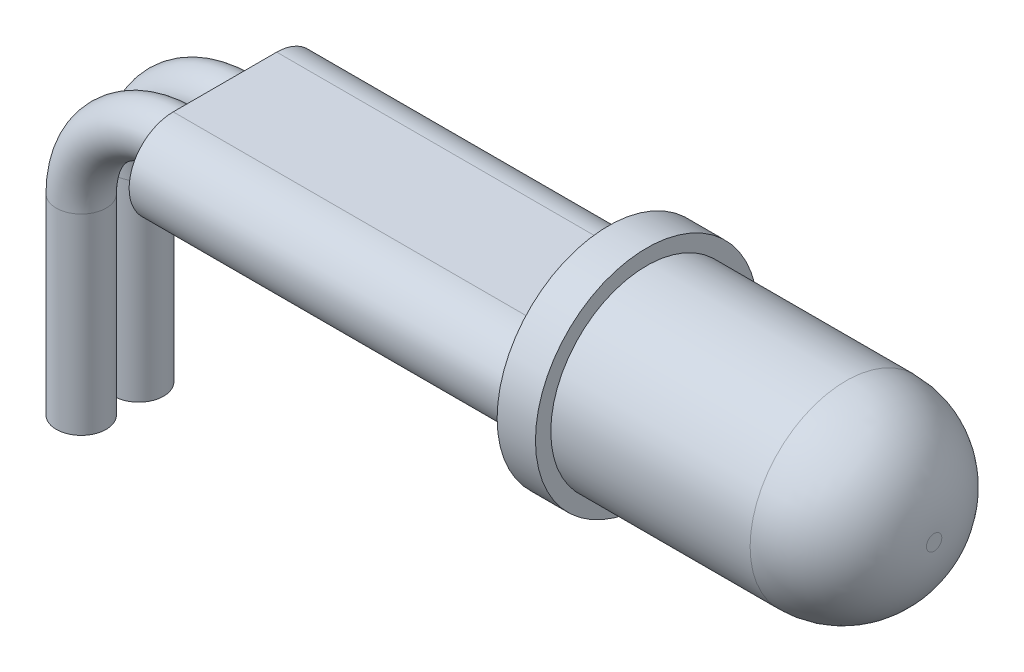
ISO-10303-21;
HEADER;
FILE_DESCRIPTION(('STEP AP214'),'2;1');
FILE_NAME('part.step','',(''),(''),'','','');
FILE_SCHEMA(('AUTOMOTIVE_DESIGN { 1 0 10303 214 1 1 1 1 }'));
ENDSEC;
DATA;
#1=APPLICATION_CONTEXT('core data for automotive mechanical design processes');
#2=APPLICATION_PROTOCOL_DEFINITION('international standard','automotive_design',2000,#1);
#3=PRODUCT_CONTEXT('',#1,'mechanical');
#4=PRODUCT('Part','Part','',(#3));
#5=PRODUCT_RELATED_PRODUCT_CATEGORY('part','',(#4));
#6=PRODUCT_DEFINITION_FORMATION('','',#4);
#7=PRODUCT_DEFINITION_CONTEXT('part definition',#1,'design');
#8=PRODUCT_DEFINITION('design','',#6,#7);
#9=PRODUCT_DEFINITION_SHAPE('','',#8);
#10=(LENGTH_UNIT() NAMED_UNIT(*) SI_UNIT(.MILLI.,.METRE.));
#11=(NAMED_UNIT(*) PLANE_ANGLE_UNIT() SI_UNIT($,.RADIAN.));
#12=(NAMED_UNIT(*) SI_UNIT($,.STERADIAN.) SOLID_ANGLE_UNIT());
#13=UNCERTAINTY_MEASURE_WITH_UNIT(LENGTH_MEASURE(1.E-05),#10,'distance_accuracy_value','');
#14=(GEOMETRIC_REPRESENTATION_CONTEXT(3) GLOBAL_UNCERTAINTY_ASSIGNED_CONTEXT((#13)) GLOBAL_UNIT_ASSIGNED_CONTEXT((#10,
#11,#12)) REPRESENTATION_CONTEXT('',''));
#15=CARTESIAN_POINT('',(0.,0.,0.));
#16=DIRECTION('',(0.,0.,1.));
#17=DIRECTION('',(1.,0.,0.));
#18=AXIS2_PLACEMENT_3D('',#15,#16,#17);
#19=CARTESIAN_POINT('',(-10.,0.,-1.35));
#20=DIRECTION('',(1.,0.,0.));
#21=DIRECTION('',(0.,0.,-1.));
#22=AXIS2_PLACEMENT_3D('',#19,#20,#21);
#23=CYLINDRICAL_SURFACE('',#22,1.15);
#24=CARTESIAN_POINT('',(0.,0.,-1.35));
#25=DIRECTION('',(-1.,0.,0.));
#26=DIRECTION('',(0.,0.,1.));
#27=AXIS2_PLACEMENT_3D('',#24,#25,#26);
#28=CIRCLE('',#27,1.15);
#29=CARTESIAN_POINT('',(0.,1.15,-1.35));
#30=VERTEX_POINT('',#29);
#31=CARTESIAN_POINT('',(0.,-1.15,-1.35));
#32=VERTEX_POINT('',#31);
#33=EDGE_CURVE('E112',#30,#32,#28,.T.);
#34=ORIENTED_EDGE('',*,*,#33,.T.);
#35=DIRECTION('',(1.,0.,0.));
#36=VECTOR('',#35,1.);
#37=CARTESIAN_POINT('',(-10.,-1.15,-1.35));
#38=LINE('',#37,#36);
#39=CARTESIAN_POINT('',(-10.,-1.15,-1.35));
#40=VERTEX_POINT('',#39);
#41=EDGE_CURVE('E48',#40,#32,#38,.T.);
#42=ORIENTED_EDGE('',*,*,#41,.F.);
#43=CARTESIAN_POINT('',(-10.,0.,-1.35));
#44=DIRECTION('',(-1.,0.,0.));
#45=DIRECTION('',(0.,0.,1.));
#46=AXIS2_PLACEMENT_3D('',#43,#44,#45);
#47=CIRCLE('',#46,1.15);
#48=CARTESIAN_POINT('',(-10.,1.15,-1.35));
#49=VERTEX_POINT('',#48);
#50=EDGE_CURVE('E99',#49,#40,#47,.T.);
#51=ORIENTED_EDGE('',*,*,#50,.F.);
#52=DIRECTION('',(1.,0.,0.));
#53=VECTOR('',#52,1.);
#54=CARTESIAN_POINT('',(-10.,1.15,-1.35));
#55=LINE('',#54,#53);
#56=EDGE_CURVE('E108',#49,#30,#55,.T.);
#57=ORIENTED_EDGE('',*,*,#56,.T.);
#58=EDGE_LOOP('',(#34,#42,#51,#57));
#59=FACE_BOUND('',#58,.T.);
#60=ADVANCED_FACE('F45',(#59),#23,.T.);
#61=CARTESIAN_POINT('',(-10.,-1.15,-1.35));
#62=DIRECTION('',(0.,1.,0.));
#63=DIRECTION('',(0.,0.,1.));
#64=AXIS2_PLACEMENT_3D('',#61,#62,#63);
#65=PLANE('',#64);
#66=DIRECTION('',(0.,0.,1.));
#67=VECTOR('',#66,1.);
#68=CARTESIAN_POINT('',(0.,-1.15,-1.35));
#69=LINE('',#68,#67);
#70=CARTESIAN_POINT('',(0.,-1.15,1.35));
#71=VERTEX_POINT('',#70);
#72=EDGE_CURVE('E104',#32,#71,#69,.T.);
#73=ORIENTED_EDGE('',*,*,#72,.T.);
#74=DIRECTION('',(1.,0.,0.));
#75=VECTOR('',#74,1.);
#76=CARTESIAN_POINT('',(-10.,-1.15,1.35));
#77=LINE('',#76,#75);
#78=CARTESIAN_POINT('',(-10.,-1.15,1.35));
#79=VERTEX_POINT('',#78);
#80=EDGE_CURVE('E102',#79,#71,#77,.T.);
#81=ORIENTED_EDGE('',*,*,#80,.F.);
#82=DIRECTION('',(0.,0.,1.));
#83=VECTOR('',#82,1.);
#84=CARTESIAN_POINT('',(-10.,-1.15,-1.35));
#85=LINE('',#84,#83);
#86=EDGE_CURVE('E94',#40,#79,#85,.T.);
#87=ORIENTED_EDGE('',*,*,#86,.F.);
#88=ORIENTED_EDGE('',*,*,#41,.T.);
#89=EDGE_LOOP('',(#73,#81,#87,#88));
#90=FACE_BOUND('',#89,.T.);
#91=ADVANCED_FACE('F103',(#90),#65,.F.);
#92=CARTESIAN_POINT('',(-10.,0.,1.35));
#93=DIRECTION('',(1.,0.,0.));
#94=DIRECTION('',(0.,0.,-1.));
#95=AXIS2_PLACEMENT_3D('',#92,#93,#94);
#96=CYLINDRICAL_SURFACE('',#95,1.15);
#97=CARTESIAN_POINT('',(0.,0.,1.35));
#98=DIRECTION('',(-1.,0.,0.));
#99=DIRECTION('',(0.,0.,1.));
#100=AXIS2_PLACEMENT_3D('',#97,#98,#99);
#101=CIRCLE('',#100,1.15);
#102=CARTESIAN_POINT('',(0.,1.15,1.35));
#103=VERTEX_POINT('',#102);
#104=EDGE_CURVE('E80',#71,#103,#101,.T.);
#105=ORIENTED_EDGE('',*,*,#104,.T.);
#106=DIRECTION('',(1.,0.,0.));
#107=VECTOR('',#106,1.);
#108=CARTESIAN_POINT('',(-10.,1.15,1.35));
#109=LINE('',#108,#107);
#110=CARTESIAN_POINT('',(-10.,1.15,1.35));
#111=VERTEX_POINT('',#110);
#112=EDGE_CURVE('E105',#111,#103,#109,.T.);
#113=ORIENTED_EDGE('',*,*,#112,.F.);
#114=CARTESIAN_POINT('',(-10.,0.,1.35));
#115=DIRECTION('',(-1.,0.,0.));
#116=DIRECTION('',(0.,0.,1.));
#117=AXIS2_PLACEMENT_3D('',#114,#115,#116);
#118=CIRCLE('',#117,1.15);
#119=EDGE_CURVE('E97',#79,#111,#118,.T.);
#120=ORIENTED_EDGE('',*,*,#119,.F.);
#121=ORIENTED_EDGE('',*,*,#80,.T.);
#122=EDGE_LOOP('',(#105,#113,#120,#121));
#123=FACE_BOUND('',#122,.T.);
#124=ADVANCED_FACE('F106',(#123),#96,.T.);
#125=CARTESIAN_POINT('',(-10.,1.15,-1.35));
#126=DIRECTION('',(0.,-1.,0.));
#127=DIRECTION('',(0.,0.,-1.));
#128=AXIS2_PLACEMENT_3D('',#125,#126,#127);
#129=PLANE('',#128);
#130=DIRECTION('',(0.,0.,-1.));
#131=VECTOR('',#130,1.);
#132=CARTESIAN_POINT('',(0.,1.15,-1.35));
#133=LINE('',#132,#131);
#134=EDGE_CURVE('E86',#103,#30,#133,.T.);
#135=ORIENTED_EDGE('',*,*,#134,.T.);
#136=ORIENTED_EDGE('',*,*,#56,.F.);
#137=DIRECTION('',(0.,0.,-1.));
#138=VECTOR('',#137,1.);
#139=CARTESIAN_POINT('',(-10.,1.15,-1.35));
#140=LINE('',#139,#138);
#141=EDGE_CURVE('E63',#111,#49,#140,.T.);
#142=ORIENTED_EDGE('',*,*,#141,.F.);
#143=ORIENTED_EDGE('',*,*,#112,.T.);
#144=EDGE_LOOP('',(#135,#136,#142,#143));
#145=FACE_BOUND('',#144,.T.);
#146=ADVANCED_FACE('F120',(#145),#129,.F.);
#147=CARTESIAN_POINT('',(-10.,0.,-1.35));
#148=DIRECTION('',(-1.,0.,0.));
#149=DIRECTION('',(0.,0.,1.));
#150=AXIS2_PLACEMENT_3D('',#147,#148,#149);
#151=PLANE('',#150);
#152=CARTESIAN_POINT('',(-10.,0.,0.75));
#153=DIRECTION('',(-1.,0.,0.));
#154=DIRECTION('',(0.,0.,1.));
#155=AXIS2_PLACEMENT_3D('',#152,#153,#154);
#156=CIRCLE('',#155,0.65);
#157=CARTESIAN_POINT('',(-10.,0.,1.4));
#158=VERTEX_POINT('',#157);
#159=EDGE_CURVE('E12',#158,#158,#156,.T.);
#160=ORIENTED_EDGE('',*,*,#159,.F.);
#161=EDGE_LOOP('',(#160));
#162=FACE_BOUND('',#161,.T.);
#163=CARTESIAN_POINT('',(-10.,0.,-0.75));
#164=DIRECTION('',(-1.,0.,0.));
#165=DIRECTION('',(0.,0.,1.));
#166=AXIS2_PLACEMENT_3D('',#163,#164,#165);
#167=CIRCLE('',#166,0.65);
#168=CARTESIAN_POINT('',(-10.,0.,-0.1));
#169=VERTEX_POINT('',#168);
#170=EDGE_CURVE('E54',#169,#169,#167,.T.);
#171=ORIENTED_EDGE('',*,*,#170,.F.);
#172=EDGE_LOOP('',(#171));
#173=FACE_BOUND('',#172,.T.);
#174=ORIENTED_EDGE('',*,*,#50,.T.);
#175=ORIENTED_EDGE('',*,*,#86,.T.);
#176=ORIENTED_EDGE('',*,*,#119,.T.);
#177=ORIENTED_EDGE('',*,*,#141,.T.);
#178=EDGE_LOOP('',(#174,#175,#176,#177));
#179=FACE_BOUND('',#178,.T.);
#180=ADVANCED_FACE('F95',(#162,#173,#179),#151,.T.);
#181=CARTESIAN_POINT('',(0.,0.,-1.35));
#182=DIRECTION('',(-1.,0.,0.));
#183=DIRECTION('',(0.,0.,1.));
#184=AXIS2_PLACEMENT_3D('',#181,#182,#183);
#185=PLANE('',#184);
#186=ORIENTED_EDGE('',*,*,#33,.F.);
#187=ORIENTED_EDGE('',*,*,#134,.F.);
#188=ORIENTED_EDGE('',*,*,#104,.F.);
#189=ORIENTED_EDGE('',*,*,#72,.F.);
#190=EDGE_LOOP('',(#186,#187,#188,#189));
#191=FACE_BOUND('',#190,.T.);
#192=ADVANCED_FACE('F123',(#191),#185,.F.);
#193=CARTESIAN_POINT('',(-13.,-2.5,-0.75));
#194=DIRECTION('',(0.,-1.,0.));
#195=DIRECTION('',(0.,0.,-1.));
#196=AXIS2_PLACEMENT_3D('',#193,#194,#195);
#197=CYLINDRICAL_SURFACE('',#196,0.65);
#198=CARTESIAN_POINT('',(-13.,-2.5,-0.75));
#199=DIRECTION('',(0.,-1.,0.));
#200=DIRECTION('',(0.,0.,1.));
#201=AXIS2_PLACEMENT_3D('',#198,#199,#200);
#202=CIRCLE('',#201,0.65);
#203=CARTESIAN_POINT('',(-13.65,-2.5,-0.75));
#204=VERTEX_POINT('',#203);
#205=EDGE_CURVE('E128',#204,#204,#202,.T.);
#206=ORIENTED_EDGE('',*,*,#205,.T.);
#207=EDGE_LOOP('',(#206));
#208=FACE_BOUND('',#207,.T.);
#209=CARTESIAN_POINT('',(-13.,-7.5,-0.75));
#210=DIRECTION('',(0.,-1.,0.));
#211=DIRECTION('',(0.,0.,1.));
#212=AXIS2_PLACEMENT_3D('',#209,#210,#211);
#213=CIRCLE('',#212,0.65);
#214=CARTESIAN_POINT('',(-13.,-7.5,-0.1));
#215=VERTEX_POINT('',#214);
#216=EDGE_CURVE('E115',#215,#215,#213,.T.);
#217=ORIENTED_EDGE('',*,*,#216,.F.);
#218=EDGE_LOOP('',(#217));
#219=FACE_BOUND('',#218,.T.);
#220=ADVANCED_FACE('F174',(#208,#219),#197,.T.);
#221=CARTESIAN_POINT('',(-10.5,-2.5,-0.75));
#222=DIRECTION('',(0.,0.,1.));
#223=DIRECTION('',(1.,0.,0.));
#224=AXIS2_PLACEMENT_3D('',#221,#222,#223);
#225=TOROIDAL_SURFACE('',#224,2.5,0.65);
#226=CARTESIAN_POINT('',(-10.5,0.,-0.75));
#227=DIRECTION('',(-1.,0.,0.));
#228=DIRECTION('',(0.,0.,1.));
#229=AXIS2_PLACEMENT_3D('',#226,#227,#228);
#230=CIRCLE('',#229,0.65);
#231=CARTESIAN_POINT('',(-10.5,0.65,-0.75));
#232=VERTEX_POINT('',#231);
#233=EDGE_CURVE('E131',#232,#232,#230,.T.);
#234=CARTESIAN_POINT('',(-10.5,-2.5,-0.75));
#235=DIRECTION('',(0.,0.,1.));
#236=DIRECTION('',(1.,0.,0.));
#237=AXIS2_PLACEMENT_3D('',#234,#235,#236);
#238=CIRCLE('',#237,3.15);
#239=EDGE_CURVE('',#232,#204,#238,.T.);
#240=ORIENTED_EDGE('',*,*,#233,.T.);
#241=ORIENTED_EDGE('',*,*,#205,.F.);
#242=ORIENTED_EDGE('',*,*,#239,.T.);
#243=ORIENTED_EDGE('',*,*,#239,.F.);
#244=EDGE_LOOP('',(#240,#242,#241,#243));
#245=FACE_BOUND('',#244,.T.);
#246=ADVANCED_FACE('F164',(#245),#225,.T.);
#247=CARTESIAN_POINT('',(-10.5,0.,-0.75));
#248=DIRECTION('',(1.,0.,0.));
#249=DIRECTION('',(0.,1.,0.));
#250=AXIS2_PLACEMENT_3D('',#247,#248,#249);
#251=CYLINDRICAL_SURFACE('',#250,0.65);
#252=ORIENTED_EDGE('',*,*,#233,.F.);
#253=EDGE_LOOP('',(#252));
#254=FACE_BOUND('',#253,.T.);
#255=ORIENTED_EDGE('',*,*,#170,.T.);
#256=EDGE_LOOP('',(#255));
#257=FACE_BOUND('',#256,.T.);
#258=ADVANCED_FACE('F161',(#254,#257),#251,.T.);
#259=CARTESIAN_POINT('',(-13.,-7.5,-0.75));
#260=DIRECTION('',(0.,-1.,0.));
#261=DIRECTION('',(0.,0.,1.));
#262=AXIS2_PLACEMENT_3D('',#259,#260,#261);
#263=PLANE('',#262);
#264=ORIENTED_EDGE('',*,*,#216,.T.);
#265=EDGE_LOOP('',(#264));
#266=FACE_BOUND('',#265,.T.);
#267=ADVANCED_FACE('F163',(#266),#263,.T.);
#268=CARTESIAN_POINT('',(-13.,-2.5,0.75));
#269=DIRECTION('',(0.,-1.,0.));
#270=DIRECTION('',(0.,0.,-1.));
#271=AXIS2_PLACEMENT_3D('',#268,#269,#270);
#272=CYLINDRICAL_SURFACE('',#271,0.65);
#273=CARTESIAN_POINT('',(-13.,-2.5,0.75));
#274=DIRECTION('',(0.,-1.,0.));
#275=DIRECTION('',(0.,0.,1.));
#276=AXIS2_PLACEMENT_3D('',#273,#274,#275);
#277=CIRCLE('',#276,0.65);
#278=CARTESIAN_POINT('',(-13.65,-2.5,0.75));
#279=VERTEX_POINT('',#278);
#280=EDGE_CURVE('E139',#279,#279,#277,.T.);
#281=ORIENTED_EDGE('',*,*,#280,.T.);
#282=EDGE_LOOP('',(#281));
#283=FACE_BOUND('',#282,.T.);
#284=CARTESIAN_POINT('',(-13.,-7.5,0.75));
#285=DIRECTION('',(0.,-1.,0.));
#286=DIRECTION('',(0.,0.,1.));
#287=AXIS2_PLACEMENT_3D('',#284,#285,#286);
#288=CIRCLE('',#287,0.65);
#289=CARTESIAN_POINT('',(-13.,-7.5,1.4));
#290=VERTEX_POINT('',#289);
#291=EDGE_CURVE('E136',#290,#290,#288,.T.);
#292=ORIENTED_EDGE('',*,*,#291,.F.);
#293=EDGE_LOOP('',(#292));
#294=FACE_BOUND('',#293,.T.);
#295=ADVANCED_FACE('F171',(#283,#294),#272,.T.);
#296=CARTESIAN_POINT('',(-10.5,-2.5,0.75));
#297=DIRECTION('',(0.,0.,1.));
#298=DIRECTION('',(1.,0.,0.));
#299=AXIS2_PLACEMENT_3D('',#296,#297,#298);
#300=TOROIDAL_SURFACE('',#299,2.5,0.65);
#301=CARTESIAN_POINT('',(-10.5,0.,0.75));
#302=DIRECTION('',(-1.,0.,0.));
#303=DIRECTION('',(0.,0.,1.));
#304=AXIS2_PLACEMENT_3D('',#301,#302,#303);
#305=CIRCLE('',#304,0.65);
#306=CARTESIAN_POINT('',(-10.5,0.65,0.75));
#307=VERTEX_POINT('',#306);
#308=EDGE_CURVE('E141',#307,#307,#305,.T.);
#309=CARTESIAN_POINT('',(-10.5,-2.5,0.75));
#310=DIRECTION('',(0.,0.,1.));
#311=DIRECTION('',(1.,0.,0.));
#312=AXIS2_PLACEMENT_3D('',#309,#310,#311);
#313=CIRCLE('',#312,3.15);
#314=EDGE_CURVE('',#307,#279,#313,.T.);
#315=ORIENTED_EDGE('',*,*,#308,.T.);
#316=ORIENTED_EDGE('',*,*,#280,.F.);
#317=ORIENTED_EDGE('',*,*,#314,.T.);
#318=ORIENTED_EDGE('',*,*,#314,.F.);
#319=EDGE_LOOP('',(#315,#317,#316,#318));
#320=FACE_BOUND('',#319,.T.);
#321=ADVANCED_FACE('F146',(#320),#300,.T.);
#322=CARTESIAN_POINT('',(-10.5,0.,0.75));
#323=DIRECTION('',(1.,0.,0.));
#324=DIRECTION('',(0.,1.,0.));
#325=AXIS2_PLACEMENT_3D('',#322,#323,#324);
#326=CYLINDRICAL_SURFACE('',#325,0.65);
#327=ORIENTED_EDGE('',*,*,#308,.F.);
#328=EDGE_LOOP('',(#327));
#329=FACE_BOUND('',#328,.T.);
#330=ORIENTED_EDGE('',*,*,#159,.T.);
#331=EDGE_LOOP('',(#330));
#332=FACE_BOUND('',#331,.T.);
#333=ADVANCED_FACE('F149',(#329,#332),#326,.T.);
#334=CARTESIAN_POINT('',(-13.,-7.5,0.75));
#335=DIRECTION('',(0.,-1.,0.));
#336=DIRECTION('',(0.,0.,1.));
#337=AXIS2_PLACEMENT_3D('',#334,#335,#336);
#338=PLANE('',#337);
#339=ORIENTED_EDGE('',*,*,#291,.T.);
#340=EDGE_LOOP('',(#339));
#341=FACE_BOUND('',#340,.T.);
#342=ADVANCED_FACE('F152',(#341),#338,.T.);
#343=CLOSED_SHELL('',(#60,#91,#124,#146,#180,#192,#220,#246,#258,#267,#295,#321,#333,#342));
#344=MANIFOLD_SOLID_BREP('B2',#343);
#345=CARTESIAN_POINT('',(0.,0.,0.));
#346=DIRECTION('',(1.,0.,0.));
#347=DIRECTION('',(0.,0.,-1.));
#348=AXIS2_PLACEMENT_3D('',#345,#346,#347);
#349=PLANE('',#348);
#350=CARTESIAN_POINT('',(0.,0.,0.));
#351=DIRECTION('',(-1.,0.,0.));
#352=DIRECTION('',(0.,0.,1.));
#353=AXIS2_PLACEMENT_3D('',#350,#351,#352);
#354=CIRCLE('',#353,2.9);
#355=CARTESIAN_POINT('',(0.,0.,2.9));
#356=VERTEX_POINT('',#355);
#357=EDGE_CURVE('E44',#356,#356,#354,.T.);
#358=ORIENTED_EDGE('',*,*,#357,.T.);
#359=EDGE_LOOP('',(#358));
#360=FACE_BOUND('',#359,.T.);
#361=ADVANCED_FACE('F305',(#360),#349,.F.);
#362=CARTESIAN_POINT('',(0.,0.,0.));
#363=DIRECTION('',(-1.,0.,0.));
#364=DIRECTION('',(0.,0.,1.));
#365=AXIS2_PLACEMENT_3D('',#362,#363,#364);
#366=CYLINDRICAL_SURFACE('',#365,2.9);
#367=ORIENTED_EDGE('',*,*,#357,.F.);
#368=EDGE_LOOP('',(#367));
#369=FACE_BOUND('',#368,.T.);
#370=CARTESIAN_POINT('',(1.,0.,0.));
#371=DIRECTION('',(-1.,0.,0.));
#372=DIRECTION('',(0.,0.,1.));
#373=AXIS2_PLACEMENT_3D('',#370,#371,#372);
#374=CIRCLE('',#373,2.9);
#375=CARTESIAN_POINT('',(1.,0.,2.9));
#376=VERTEX_POINT('',#375);
#377=EDGE_CURVE('E311',#376,#376,#374,.T.);
#378=ORIENTED_EDGE('',*,*,#377,.T.);
#379=EDGE_LOOP('',(#378));
#380=FACE_BOUND('',#379,.T.);
#381=ADVANCED_FACE('F340',(#369,#380),#366,.T.);
#382=CARTESIAN_POINT('',(1.,2.9,0.));
#383=DIRECTION('',(-1.,0.,0.));
#384=DIRECTION('',(0.,0.,1.));
#385=AXIS2_PLACEMENT_3D('',#382,#383,#384);
#386=PLANE('',#385);
#387=ORIENTED_EDGE('',*,*,#377,.F.);
#388=EDGE_LOOP('',(#387));
#389=FACE_BOUND('',#388,.T.);
#390=CARTESIAN_POINT('',(1.,0.,0.));
#391=DIRECTION('',(-1.,0.,0.));
#392=DIRECTION('',(0.,0.,1.));
#393=AXIS2_PLACEMENT_3D('',#390,#391,#392);
#394=CIRCLE('',#393,2.5);
#395=CARTESIAN_POINT('',(1.,0.,2.5));
#396=VERTEX_POINT('',#395);
#397=EDGE_CURVE('E315',#396,#396,#394,.T.);
#398=ORIENTED_EDGE('',*,*,#397,.T.);
#399=EDGE_LOOP('',(#398));
#400=FACE_BOUND('',#399,.T.);
#401=ADVANCED_FACE('F344',(#389,#400),#386,.F.);
#402=CARTESIAN_POINT('',(0.,0.,0.));
#403=DIRECTION('',(-1.,0.,0.));
#404=DIRECTION('',(0.,0.,1.));
#405=AXIS2_PLACEMENT_3D('',#402,#403,#404);
#406=CYLINDRICAL_SURFACE('',#405,2.5);
#407=ORIENTED_EDGE('',*,*,#397,.F.);
#408=EDGE_LOOP('',(#407));
#409=FACE_BOUND('',#408,.T.);
#410=CARTESIAN_POINT('',(6.19999999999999,0.,0.));
#411=DIRECTION('',(-1.,0.,0.));
#412=DIRECTION('',(0.,0.,1.));
#413=AXIS2_PLACEMENT_3D('',#410,#411,#412);
#414=CIRCLE('',#413,2.5);
#415=CARTESIAN_POINT('',(6.19999999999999,0.,2.5));
#416=VERTEX_POINT('',#415);
#417=EDGE_CURVE('E319',#416,#416,#414,.T.);
#418=ORIENTED_EDGE('',*,*,#417,.T.);
#419=EDGE_LOOP('',(#418));
#420=FACE_BOUND('',#419,.T.);
#421=ADVANCED_FACE('F336',(#409,#420),#406,.T.);
#422=CARTESIAN_POINT('',(6.2,0.,0.));
#423=DIRECTION('',(-1.,0.,0.));
#424=DIRECTION('',(0.,0.,1.));
#425=AXIS2_PLACEMENT_3D('',#422,#423,#424);
#426=DEGENERATE_TOROIDAL_SURFACE('',#425,0.2,2.3,.T.);
#427=ORIENTED_EDGE('',*,*,#417,.F.);
#428=EDGE_LOOP('',(#427));
#429=FACE_BOUND('',#428,.T.);
#430=CARTESIAN_POINT('',(8.5,0.,0.));
#431=DIRECTION('',(-1.,0.,0.));
#432=DIRECTION('',(0.,0.,1.));
#433=AXIS2_PLACEMENT_3D('',#430,#431,#432);
#434=CIRCLE('',#433,0.199999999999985);
#435=CARTESIAN_POINT('',(8.5,0.,0.199999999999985));
#436=VERTEX_POINT('',#435);
#437=EDGE_CURVE('E324',#436,#436,#434,.T.);
#438=ORIENTED_EDGE('',*,*,#437,.T.);
#439=EDGE_LOOP('',(#438));
#440=FACE_BOUND('',#439,.T.);
#441=ADVANCED_FACE('F328',(#429,#440),#426,.T.);
#442=CARTESIAN_POINT('',(8.5,0.199999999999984,0.));
#443=DIRECTION('',(-1.,0.,0.));
#444=DIRECTION('',(0.,0.,1.));
#445=AXIS2_PLACEMENT_3D('',#442,#443,#444);
#446=PLANE('',#445);
#447=ORIENTED_EDGE('',*,*,#437,.F.);
#448=EDGE_LOOP('',(#447));
#449=FACE_BOUND('',#448,.T.);
#450=ADVANCED_FACE('F330',(#449),#446,.F.);
#451=CLOSED_SHELL('',(#361,#381,#401,#421,#441,#450));
#452=MANIFOLD_SOLID_BREP('B6',#451);
#453=ADVANCED_BREP_SHAPE_REPRESENTATION('',(#18,#344,#452),#14);
#454=SHAPE_DEFINITION_REPRESENTATION(#9,#453);
ENDSEC;
END-ISO-10303-21;
